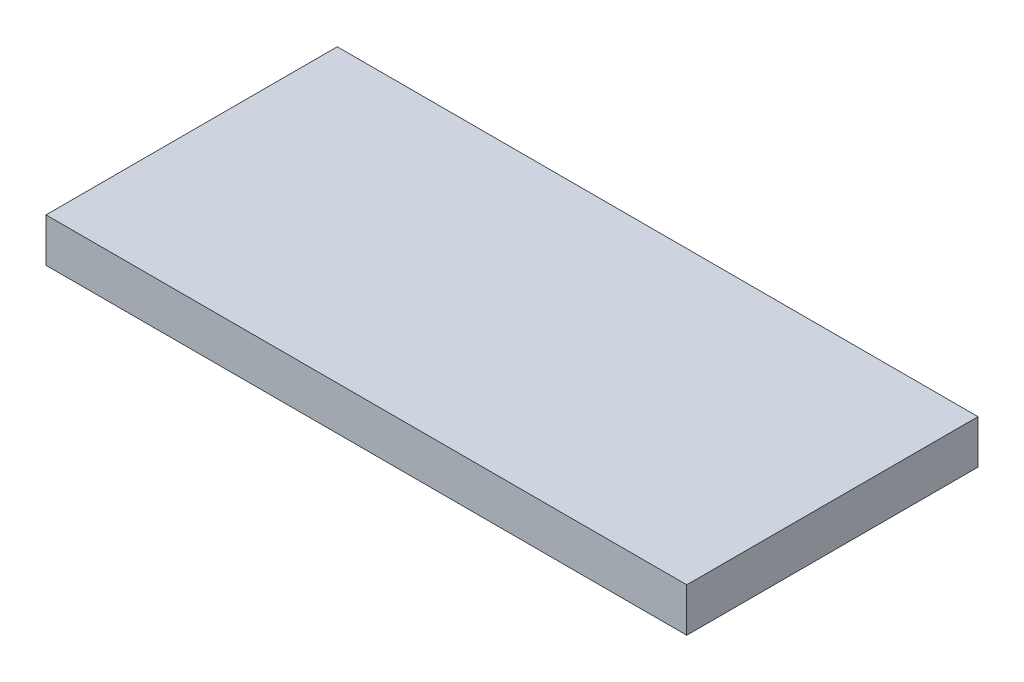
from build123d import *

# Parameters (mm, degrees)
SKETCH1_W           = 69.85
SKETCH1_H           = 31.75
BOSS_EXTRUDE1_DEPTH = 4.7625


with BuildPart() as part:
    # Sketch1 → Boss-Extrude1 (new body)
    with BuildSketch(Plane(origin=(0, 0, 0), x_dir=(1, 0, 0), z_dir=(0, 1, 0))):
        Rectangle(SKETCH1_W, SKETCH1_H)
    extrude(amount=BOSS_EXTRUDE1_DEPTH)


solid = part.part
